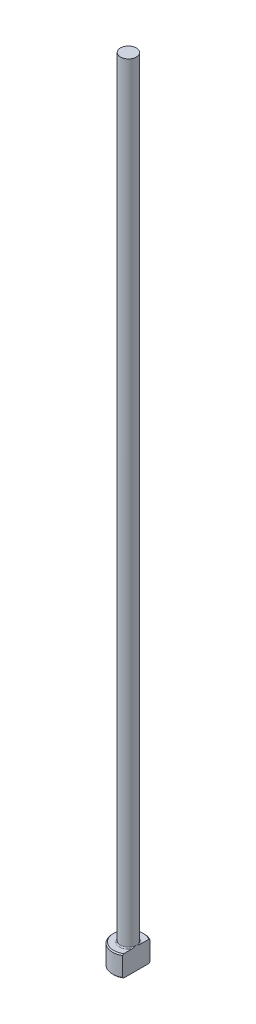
from build123d import *
from build123d.topology import SkipClean

# Parameters (mm, degrees)
CHAMFER1_SIZE    = 0.2
FILLET1_R        = 0.2
KEYED_HEAD_DEPTH = 151.059988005


with BuildPart() as part:
    # Sketch1 → Revolve1 (revolve)
    with BuildSketch(Plane.XY, mode=Mode.PRIVATE) as revolve1_sk:
        Polygon((0, 0), (-3, 0), (-3, 4), (-1.5, 4), (-1.5, 150), (0, 150), align=None)
    revolve(revolve1_sk.sketch.rotate(Axis((0, 259.958771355, 0), (0, -1, 0)), 270), axis=Axis((0, 259.958771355, 0), (0, -1, 0)))

    # Chamfer1
    chamfer1_edges = [part.edges().sort_by_distance(p)[0] for p in [
        (0, 4, -3),
        (0, 0, -3),
    ]]
    chamfer(chamfer1_edges, length=CHAMFER1_SIZE)

    # Fillet1
    fillet1_edges = [part.edges().sort_by_distance(p)[0] for p in [
        (0, 4, -1.5),
    ]]
    fillet(fillet1_edges, radius=FILLET1_R)

    # Sketch2 → KEYED HEAD (cut, through all)
    with SkipClean():  # the faces are left unmerged after this step: merging them gives an invalid solid
        with BuildSketch(Plane(origin=(0, 0, 0), x_dir=(1, 0, 0), z_dir=(0, 1, 0))):
            with BuildLine():
                Line((1.5, -2.598076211), (1.5, 2.598076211))
                ThreePointArc((1.5, 2.598076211), (3, 0), (1.5, -2.598076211))
            make_face()
        extrude(amount=KEYED_HEAD_DEPTH, mode=Mode.SUBTRACT)


solid = part.part
